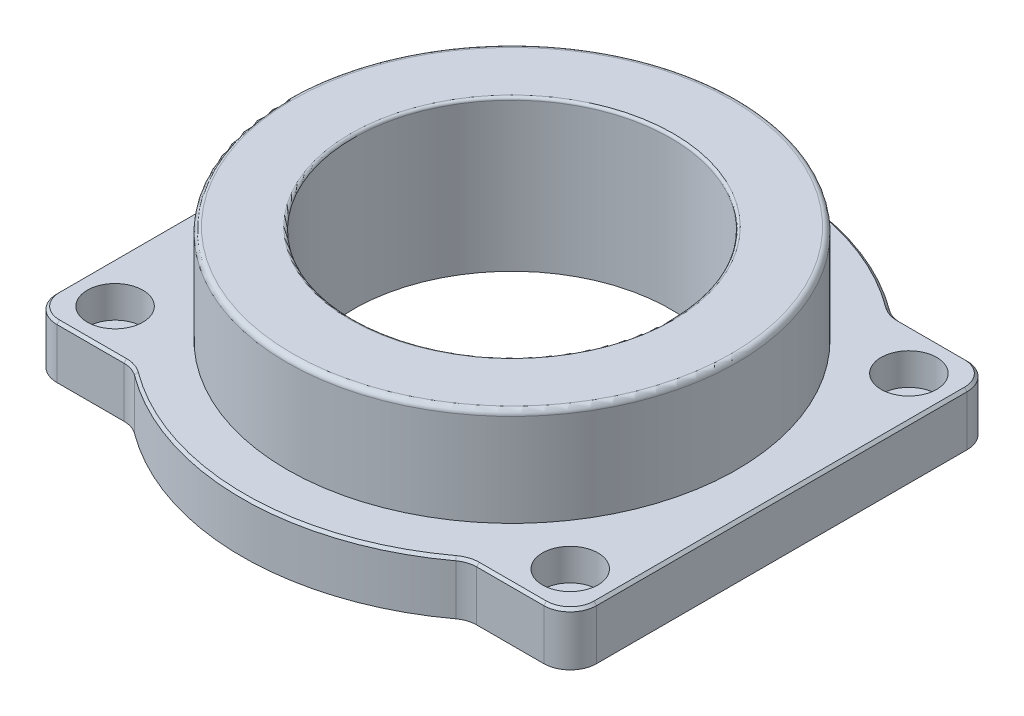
ISO-10303-21;
HEADER;
FILE_DESCRIPTION(('STEP AP214'),'2;1');
FILE_NAME('part.step','',(''),(''),'','','');
FILE_SCHEMA(('AUTOMOTIVE_DESIGN { 1 0 10303 214 1 1 1 1 }'));
ENDSEC;
DATA;
#1=APPLICATION_CONTEXT('core data for automotive mechanical design processes');
#2=APPLICATION_PROTOCOL_DEFINITION('international standard','automotive_design',2000,#1);
#3=PRODUCT_CONTEXT('',#1,'mechanical');
#4=PRODUCT('Part','Part','',(#3));
#5=PRODUCT_RELATED_PRODUCT_CATEGORY('part','',(#4));
#6=PRODUCT_DEFINITION_FORMATION('','',#4);
#7=PRODUCT_DEFINITION_CONTEXT('part definition',#1,'design');
#8=PRODUCT_DEFINITION('design','',#6,#7);
#9=PRODUCT_DEFINITION_SHAPE('','',#8);
#10=(LENGTH_UNIT() NAMED_UNIT(*) SI_UNIT(.MILLI.,.METRE.));
#11=(NAMED_UNIT(*) PLANE_ANGLE_UNIT() SI_UNIT($,.RADIAN.));
#12=(NAMED_UNIT(*) SI_UNIT($,.STERADIAN.) SOLID_ANGLE_UNIT());
#13=UNCERTAINTY_MEASURE_WITH_UNIT(LENGTH_MEASURE(1.E-05),#10,'distance_accuracy_value','');
#14=(GEOMETRIC_REPRESENTATION_CONTEXT(3) GLOBAL_UNCERTAINTY_ASSIGNED_CONTEXT((#13)) GLOBAL_UNIT_ASSIGNED_CONTEXT((#10,
#11,#12)) REPRESENTATION_CONTEXT('',''));
#15=CARTESIAN_POINT('',(0.,0.,0.));
#16=DIRECTION('',(0.,0.,1.));
#17=DIRECTION('',(1.,0.,0.));
#18=AXIS2_PLACEMENT_3D('',#15,#16,#17);
#19=CARTESIAN_POINT('',(-46.,10.,35.));
#20=DIRECTION('',(0.,-1.,0.));
#21=DIRECTION('',(0.,0.,-1.));
#22=AXIS2_PLACEMENT_3D('',#19,#20,#21);
#23=CYLINDRICAL_SURFACE('',#22,4.99999999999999);
#24=DIRECTION('',(0.,-1.,0.));
#25=VECTOR('',#24,1.);
#26=CARTESIAN_POINT('',(-46.,10.,40.));
#27=LINE('',#26,#25);
#28=CARTESIAN_POINT('',(-46.,9.50000000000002,40.));
#29=VERTEX_POINT('',#28);
#30=CARTESIAN_POINT('',(-46.,0.,40.));
#31=VERTEX_POINT('',#30);
#32=EDGE_CURVE('E195',#29,#31,#27,.T.);
#33=ORIENTED_EDGE('',*,*,#32,.F.);
#34=CARTESIAN_POINT('',(-46.,9.50000000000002,35.));
#35=DIRECTION('',(0.,1.,0.));
#36=DIRECTION('',(0.,0.,1.));
#37=AXIS2_PLACEMENT_3D('',#34,#35,#36);
#38=CIRCLE('',#37,4.99999999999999);
#39=CARTESIAN_POINT('',(-51.,9.50000000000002,35.));
#40=VERTEX_POINT('',#39);
#41=EDGE_CURVE('E339',#29,#40,#38,.F.);
#42=ORIENTED_EDGE('',*,*,#41,.T.);
#43=DIRECTION('',(0.,-1.,0.));
#44=VECTOR('',#43,1.);
#45=CARTESIAN_POINT('',(-51.,10.,35.));
#46=LINE('',#45,#44);
#47=CARTESIAN_POINT('',(-51.,0.,35.));
#48=VERTEX_POINT('',#47);
#49=EDGE_CURVE('E219',#40,#48,#46,.T.);
#50=ORIENTED_EDGE('',*,*,#49,.T.);
#51=CARTESIAN_POINT('',(-46.,0.,35.));
#52=DIRECTION('',(0.,1.,0.));
#53=DIRECTION('',(0.,0.,1.));
#54=AXIS2_PLACEMENT_3D('',#51,#52,#53);
#55=CIRCLE('',#54,4.99999999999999);
#56=EDGE_CURVE('E213',#48,#31,#55,.T.);
#57=ORIENTED_EDGE('',*,*,#56,.T.);
#58=EDGE_LOOP('',(#33,#42,#50,#57));
#59=FACE_BOUND('',#58,.T.);
#60=ADVANCED_FACE('F33',(#59),#23,.T.);
#61=CARTESIAN_POINT('',(-46.,10.,40.));
#62=DIRECTION('',(0.,0.,-1.));
#63=DIRECTION('',(-1.,0.,0.));
#64=AXIS2_PLACEMENT_3D('',#61,#62,#63);
#65=PLANE('',#64);
#66=DIRECTION('',(0.,-1.,0.));
#67=VECTOR('',#66,1.);
#68=CARTESIAN_POINT('',(-33.3316666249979,10.,40.));
#69=LINE('',#68,#67);
#70=CARTESIAN_POINT('',(-33.3316666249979,9.50000000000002,40.));
#71=VERTEX_POINT('',#70);
#72=CARTESIAN_POINT('',(-33.3316666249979,0.,40.));
#73=VERTEX_POINT('',#72);
#74=EDGE_CURVE('E207',#71,#73,#69,.T.);
#75=ORIENTED_EDGE('',*,*,#74,.F.);
#76=DIRECTION('',(-1.,0.,0.));
#77=VECTOR('',#76,1.);
#78=CARTESIAN_POINT('',(-46.,9.50000000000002,40.));
#79=LINE('',#78,#77);
#80=EDGE_CURVE('E202',#71,#29,#79,.T.);
#81=ORIENTED_EDGE('',*,*,#80,.T.);
#82=ORIENTED_EDGE('',*,*,#32,.T.);
#83=DIRECTION('',(1.,0.,0.));
#84=VECTOR('',#83,1.);
#85=CARTESIAN_POINT('',(-46.,0.,40.));
#86=LINE('',#85,#84);
#87=EDGE_CURVE('E199',#31,#73,#86,.T.);
#88=ORIENTED_EDGE('',*,*,#87,.T.);
#89=EDGE_LOOP('',(#75,#81,#82,#88));
#90=FACE_BOUND('',#89,.T.);
#91=ADVANCED_FACE('F198',(#90),#65,.F.);
#92=CARTESIAN_POINT('',(-33.3316666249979,10.,45.));
#93=DIRECTION('',(0.,-1.,0.));
#94=DIRECTION('',(0.,0.,-1.));
#95=AXIS2_PLACEMENT_3D('',#92,#93,#94);
#96=CYLINDRICAL_SURFACE('',#95,4.99999999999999);
#97=DIRECTION('',(0.,-1.,0.));
#98=VECTOR('',#97,1.);
#99=CARTESIAN_POINT('',(-30.3556249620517,10.,40.9821428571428));
#100=LINE('',#99,#98);
#101=CARTESIAN_POINT('',(-30.3556249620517,9.50000000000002,40.9821428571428));
#102=VERTEX_POINT('',#101);
#103=CARTESIAN_POINT('',(-30.3556249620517,0.,40.9821428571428));
#104=VERTEX_POINT('',#103);
#105=EDGE_CURVE('E292',#102,#104,#100,.T.);
#106=ORIENTED_EDGE('',*,*,#105,.F.);
#107=CARTESIAN_POINT('',(-33.3316666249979,9.50000000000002,45.));
#108=DIRECTION('',(0.,1.,0.));
#109=DIRECTION('',(0.,0.,1.));
#110=AXIS2_PLACEMENT_3D('',#107,#108,#109);
#111=CIRCLE('',#110,4.99999999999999);
#112=EDGE_CURVE('E332',#102,#71,#111,.T.);
#113=ORIENTED_EDGE('',*,*,#112,.T.);
#114=ORIENTED_EDGE('',*,*,#74,.T.);
#115=CARTESIAN_POINT('',(-33.3316666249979,0.,45.));
#116=DIRECTION('',(0.,-1.,0.));
#117=DIRECTION('',(0.,0.,1.));
#118=AXIS2_PLACEMENT_3D('',#115,#116,#117);
#119=CIRCLE('',#118,4.99999999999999);
#120=EDGE_CURVE('E216',#73,#104,#119,.T.);
#121=ORIENTED_EDGE('',*,*,#120,.T.);
#122=EDGE_LOOP('',(#106,#113,#114,#121));
#123=FACE_BOUND('',#122,.T.);
#124=ADVANCED_FACE('F429',(#123),#96,.F.);
#125=CARTESIAN_POINT('',(0.,10.,0.));
#126=DIRECTION('',(0.,-1.,0.));
#127=DIRECTION('',(0.,0.,-1.));
#128=AXIS2_PLACEMENT_3D('',#125,#126,#127);
#129=CYLINDRICAL_SURFACE('',#128,51.);
#130=DIRECTION('',(0.,-1.,0.));
#131=VECTOR('',#130,1.);
#132=CARTESIAN_POINT('',(30.3556249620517,10.,40.9821428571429));
#133=LINE('',#132,#131);
#134=CARTESIAN_POINT('',(30.3556249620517,9.50000000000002,40.9821428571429));
#135=VERTEX_POINT('',#134);
#136=CARTESIAN_POINT('',(30.3556249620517,0.,40.9821428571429));
#137=VERTEX_POINT('',#136);
#138=EDGE_CURVE('E290',#135,#137,#133,.T.);
#139=ORIENTED_EDGE('',*,*,#138,.F.);
#140=CARTESIAN_POINT('',(0.,9.50000000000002,0.));
#141=DIRECTION('',(0.,1.,0.));
#142=DIRECTION('',(0.,0.,1.));
#143=AXIS2_PLACEMENT_3D('',#140,#141,#142);
#144=CIRCLE('',#143,51.);
#145=EDGE_CURVE('E327',#135,#102,#144,.F.);
#146=ORIENTED_EDGE('',*,*,#145,.T.);
#147=ORIENTED_EDGE('',*,*,#105,.T.);
#148=CARTESIAN_POINT('',(0.,0.,0.));
#149=DIRECTION('',(0.,1.,0.));
#150=DIRECTION('',(0.,0.,1.));
#151=AXIS2_PLACEMENT_3D('',#148,#149,#150);
#152=CIRCLE('',#151,51.);
#153=EDGE_CURVE('E229',#104,#137,#152,.T.);
#154=ORIENTED_EDGE('',*,*,#153,.T.);
#155=EDGE_LOOP('',(#139,#146,#147,#154));
#156=FACE_BOUND('',#155,.T.);
#157=ADVANCED_FACE('F571',(#156),#129,.T.);
#158=CARTESIAN_POINT('',(33.3316666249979,10.,45.));
#159=DIRECTION('',(0.,-1.,0.));
#160=DIRECTION('',(0.,0.,-1.));
#161=AXIS2_PLACEMENT_3D('',#158,#159,#160);
#162=CYLINDRICAL_SURFACE('',#161,4.99999999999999);
#163=DIRECTION('',(0.,-1.,0.));
#164=VECTOR('',#163,1.);
#165=CARTESIAN_POINT('',(33.3316666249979,10.,40.));
#166=LINE('',#165,#164);
#167=CARTESIAN_POINT('',(33.3316666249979,9.50000000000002,40.));
#168=VERTEX_POINT('',#167);
#169=CARTESIAN_POINT('',(33.3316666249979,0.,40.));
#170=VERTEX_POINT('',#169);
#171=EDGE_CURVE('E288',#168,#170,#166,.T.);
#172=ORIENTED_EDGE('',*,*,#171,.F.);
#173=CARTESIAN_POINT('',(33.3316666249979,9.50000000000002,45.));
#174=DIRECTION('',(0.,1.,0.));
#175=DIRECTION('',(0.,0.,1.));
#176=AXIS2_PLACEMENT_3D('',#173,#174,#175);
#177=CIRCLE('',#176,4.99999999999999);
#178=EDGE_CURVE('E330',#168,#135,#177,.T.);
#179=ORIENTED_EDGE('',*,*,#178,.T.);
#180=ORIENTED_EDGE('',*,*,#138,.T.);
#181=CARTESIAN_POINT('',(33.3316666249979,0.,45.));
#182=DIRECTION('',(0.,-1.,0.));
#183=DIRECTION('',(0.,0.,-1.));
#184=AXIS2_PLACEMENT_3D('',#181,#182,#183);
#185=CIRCLE('',#184,4.99999999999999);
#186=EDGE_CURVE('E232',#137,#170,#185,.T.);
#187=ORIENTED_EDGE('',*,*,#186,.T.);
#188=EDGE_LOOP('',(#172,#179,#180,#187));
#189=FACE_BOUND('',#188,.T.);
#190=ADVANCED_FACE('F568',(#189),#162,.F.);
#191=CARTESIAN_POINT('',(33.3316666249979,10.,40.));
#192=DIRECTION('',(0.,0.,-1.));
#193=DIRECTION('',(-1.,0.,0.));
#194=AXIS2_PLACEMENT_3D('',#191,#192,#193);
#195=PLANE('',#194);
#196=DIRECTION('',(0.,-1.,0.));
#197=VECTOR('',#196,1.);
#198=CARTESIAN_POINT('',(46.,10.,40.));
#199=LINE('',#198,#197);
#200=CARTESIAN_POINT('',(46.,9.50000000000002,40.));
#201=VERTEX_POINT('',#200);
#202=CARTESIAN_POINT('',(46.,0.,40.));
#203=VERTEX_POINT('',#202);
#204=EDGE_CURVE('E286',#201,#203,#199,.T.);
#205=ORIENTED_EDGE('',*,*,#204,.F.);
#206=DIRECTION('',(-1.,0.,0.));
#207=VECTOR('',#206,1.);
#208=CARTESIAN_POINT('',(33.3316666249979,9.50000000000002,40.));
#209=LINE('',#208,#207);
#210=EDGE_CURVE('E334',#201,#168,#209,.T.);
#211=ORIENTED_EDGE('',*,*,#210,.T.);
#212=ORIENTED_EDGE('',*,*,#171,.T.);
#213=DIRECTION('',(1.,0.,0.));
#214=VECTOR('',#213,1.);
#215=CARTESIAN_POINT('',(33.3316666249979,0.,40.));
#216=LINE('',#215,#214);
#217=EDGE_CURVE('E235',#170,#203,#216,.T.);
#218=ORIENTED_EDGE('',*,*,#217,.T.);
#219=EDGE_LOOP('',(#205,#211,#212,#218));
#220=FACE_BOUND('',#219,.T.);
#221=ADVANCED_FACE('F563',(#220),#195,.F.);
#222=CARTESIAN_POINT('',(46.,10.,35.));
#223=DIRECTION('',(0.,-1.,0.));
#224=DIRECTION('',(0.,0.,-1.));
#225=AXIS2_PLACEMENT_3D('',#222,#223,#224);
#226=CYLINDRICAL_SURFACE('',#225,5.);
#227=DIRECTION('',(0.,-1.,0.));
#228=VECTOR('',#227,1.);
#229=CARTESIAN_POINT('',(51.,10.,35.));
#230=LINE('',#229,#228);
#231=CARTESIAN_POINT('',(51.,9.50000000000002,35.));
#232=VERTEX_POINT('',#231);
#233=CARTESIAN_POINT('',(51.,0.,35.));
#234=VERTEX_POINT('',#233);
#235=EDGE_CURVE('E284',#232,#234,#230,.T.);
#236=ORIENTED_EDGE('',*,*,#235,.F.);
#237=CARTESIAN_POINT('',(46.,9.50000000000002,35.));
#238=DIRECTION('',(0.,1.,0.));
#239=DIRECTION('',(0.,0.,1.));
#240=AXIS2_PLACEMENT_3D('',#237,#238,#239);
#241=CIRCLE('',#240,5.);
#242=EDGE_CURVE('E337',#232,#201,#241,.F.);
#243=ORIENTED_EDGE('',*,*,#242,.T.);
#244=ORIENTED_EDGE('',*,*,#204,.T.);
#245=CARTESIAN_POINT('',(46.,0.,35.));
#246=DIRECTION('',(0.,1.,0.));
#247=DIRECTION('',(0.,0.,1.));
#248=AXIS2_PLACEMENT_3D('',#245,#246,#247);
#249=CIRCLE('',#248,5.);
#250=EDGE_CURVE('E238',#203,#234,#249,.T.);
#251=ORIENTED_EDGE('',*,*,#250,.T.);
#252=EDGE_LOOP('',(#236,#243,#244,#251));
#253=FACE_BOUND('',#252,.T.);
#254=ADVANCED_FACE('F557',(#253),#226,.T.);
#255=CARTESIAN_POINT('',(51.,10.,-35.));
#256=DIRECTION('',(-1.,0.,0.));
#257=DIRECTION('',(0.,0.,1.));
#258=AXIS2_PLACEMENT_3D('',#255,#256,#257);
#259=PLANE('',#258);
#260=DIRECTION('',(0.,-1.,0.));
#261=VECTOR('',#260,1.);
#262=CARTESIAN_POINT('',(51.,10.,-35.));
#263=LINE('',#262,#261);
#264=CARTESIAN_POINT('',(51.,9.50000000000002,-35.));
#265=VERTEX_POINT('',#264);
#266=CARTESIAN_POINT('',(51.,0.,-35.));
#267=VERTEX_POINT('',#266);
#268=EDGE_CURVE('E282',#265,#267,#263,.T.);
#269=ORIENTED_EDGE('',*,*,#268,.F.);
#270=DIRECTION('',(0.,0.,1.));
#271=VECTOR('',#270,1.);
#272=CARTESIAN_POINT('',(51.,9.50000000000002,35.));
#273=LINE('',#272,#271);
#274=EDGE_CURVE('E341',#265,#232,#273,.T.);
#275=ORIENTED_EDGE('',*,*,#274,.T.);
#276=ORIENTED_EDGE('',*,*,#235,.T.);
#277=DIRECTION('',(0.,0.,-1.));
#278=VECTOR('',#277,1.);
#279=CARTESIAN_POINT('',(51.,0.,-35.));
#280=LINE('',#279,#278);
#281=EDGE_CURVE('E241',#234,#267,#280,.T.);
#282=ORIENTED_EDGE('',*,*,#281,.T.);
#283=EDGE_LOOP('',(#269,#275,#276,#282));
#284=FACE_BOUND('',#283,.T.);
#285=ADVANCED_FACE('F550',(#284),#259,.F.);
#286=CARTESIAN_POINT('',(46.,10.,-35.));
#287=DIRECTION('',(0.,-1.,0.));
#288=DIRECTION('',(0.,0.,-1.));
#289=AXIS2_PLACEMENT_3D('',#286,#287,#288);
#290=CYLINDRICAL_SURFACE('',#289,5.);
#291=DIRECTION('',(0.,-1.,0.));
#292=VECTOR('',#291,1.);
#293=CARTESIAN_POINT('',(46.,10.,-40.));
#294=LINE('',#293,#292);
#295=CARTESIAN_POINT('',(46.,9.50000000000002,-40.));
#296=VERTEX_POINT('',#295);
#297=CARTESIAN_POINT('',(46.,0.,-40.));
#298=VERTEX_POINT('',#297);
#299=EDGE_CURVE('E280',#296,#298,#294,.T.);
#300=ORIENTED_EDGE('',*,*,#299,.F.);
#301=CARTESIAN_POINT('',(46.,9.50000000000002,-35.));
#302=DIRECTION('',(0.,1.,0.));
#303=DIRECTION('',(0.,0.,1.));
#304=AXIS2_PLACEMENT_3D('',#301,#302,#303);
#305=CIRCLE('',#304,5.);
#306=EDGE_CURVE('E345',#296,#265,#305,.F.);
#307=ORIENTED_EDGE('',*,*,#306,.T.);
#308=ORIENTED_EDGE('',*,*,#268,.T.);
#309=CARTESIAN_POINT('',(46.,0.,-35.));
#310=DIRECTION('',(0.,1.,0.));
#311=DIRECTION('',(0.,0.,-1.));
#312=AXIS2_PLACEMENT_3D('',#309,#310,#311);
#313=CIRCLE('',#312,5.);
#314=EDGE_CURVE('E244',#267,#298,#313,.T.);
#315=ORIENTED_EDGE('',*,*,#314,.T.);
#316=EDGE_LOOP('',(#300,#307,#308,#315));
#317=FACE_BOUND('',#316,.T.);
#318=ADVANCED_FACE('F548',(#317),#290,.T.);
#319=CARTESIAN_POINT('',(33.3316666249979,10.,-40.));
#320=DIRECTION('',(0.,0.,1.));
#321=DIRECTION('',(1.,0.,0.));
#322=AXIS2_PLACEMENT_3D('',#319,#320,#321);
#323=PLANE('',#322);
#324=DIRECTION('',(0.,-1.,0.));
#325=VECTOR('',#324,1.);
#326=CARTESIAN_POINT('',(33.3316666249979,10.,-40.));
#327=LINE('',#326,#325);
#328=CARTESIAN_POINT('',(33.3316666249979,9.50000000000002,-40.));
#329=VERTEX_POINT('',#328);
#330=CARTESIAN_POINT('',(33.3316666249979,0.,-40.));
#331=VERTEX_POINT('',#330);
#332=EDGE_CURVE('E278',#329,#331,#327,.T.);
#333=ORIENTED_EDGE('',*,*,#332,.F.);
#334=DIRECTION('',(1.,0.,0.));
#335=VECTOR('',#334,1.);
#336=CARTESIAN_POINT('',(46.,9.50000000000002,-40.));
#337=LINE('',#336,#335);
#338=EDGE_CURVE('E349',#329,#296,#337,.T.);
#339=ORIENTED_EDGE('',*,*,#338,.T.);
#340=ORIENTED_EDGE('',*,*,#299,.T.);
#341=DIRECTION('',(-1.,0.,0.));
#342=VECTOR('',#341,1.);
#343=CARTESIAN_POINT('',(33.3316666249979,0.,-40.));
#344=LINE('',#343,#342);
#345=EDGE_CURVE('E247',#298,#331,#344,.T.);
#346=ORIENTED_EDGE('',*,*,#345,.T.);
#347=EDGE_LOOP('',(#333,#339,#340,#346));
#348=FACE_BOUND('',#347,.T.);
#349=ADVANCED_FACE('F513',(#348),#323,.F.);
#350=CARTESIAN_POINT('',(33.3316666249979,10.,-45.));
#351=DIRECTION('',(0.,-1.,0.));
#352=DIRECTION('',(0.,0.,-1.));
#353=AXIS2_PLACEMENT_3D('',#350,#351,#352);
#354=CYLINDRICAL_SURFACE('',#353,4.99999999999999);
#355=DIRECTION('',(0.,-1.,0.));
#356=VECTOR('',#355,1.);
#357=CARTESIAN_POINT('',(30.3556249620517,10.,-40.9821428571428));
#358=LINE('',#357,#356);
#359=CARTESIAN_POINT('',(30.3556249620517,9.50000000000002,-40.9821428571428));
#360=VERTEX_POINT('',#359);
#361=CARTESIAN_POINT('',(30.3556249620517,0.,-40.9821428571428));
#362=VERTEX_POINT('',#361);
#363=EDGE_CURVE('E276',#360,#362,#358,.T.);
#364=ORIENTED_EDGE('',*,*,#363,.F.);
#365=CARTESIAN_POINT('',(33.3316666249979,9.50000000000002,-45.));
#366=DIRECTION('',(0.,1.,0.));
#367=DIRECTION('',(0.,0.,1.));
#368=AXIS2_PLACEMENT_3D('',#365,#366,#367);
#369=CIRCLE('',#368,4.99999999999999);
#370=EDGE_CURVE('E353',#360,#329,#369,.T.);
#371=ORIENTED_EDGE('',*,*,#370,.T.);
#372=ORIENTED_EDGE('',*,*,#332,.T.);
#373=CARTESIAN_POINT('',(33.3316666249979,0.,-45.));
#374=DIRECTION('',(0.,-1.,0.));
#375=DIRECTION('',(0.,0.,1.));
#376=AXIS2_PLACEMENT_3D('',#373,#374,#375);
#377=CIRCLE('',#376,4.99999999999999);
#378=EDGE_CURVE('E250',#331,#362,#377,.T.);
#379=ORIENTED_EDGE('',*,*,#378,.T.);
#380=EDGE_LOOP('',(#364,#371,#372,#379));
#381=FACE_BOUND('',#380,.T.);
#382=ADVANCED_FACE('F511',(#381),#354,.F.);
#383=CARTESIAN_POINT('',(0.,10.,0.));
#384=DIRECTION('',(0.,-1.,0.));
#385=DIRECTION('',(0.,0.,-1.));
#386=AXIS2_PLACEMENT_3D('',#383,#384,#385);
#387=CYLINDRICAL_SURFACE('',#386,51.);
#388=DIRECTION('',(0.,-1.,0.));
#389=VECTOR('',#388,1.);
#390=CARTESIAN_POINT('',(-30.3556249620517,10.,-40.9821428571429));
#391=LINE('',#390,#389);
#392=CARTESIAN_POINT('',(-30.3556249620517,9.50000000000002,-40.9821428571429));
#393=VERTEX_POINT('',#392);
#394=CARTESIAN_POINT('',(-30.3556249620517,0.,-40.9821428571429));
#395=VERTEX_POINT('',#394);
#396=EDGE_CURVE('E274',#393,#395,#391,.T.);
#397=ORIENTED_EDGE('',*,*,#396,.F.);
#398=CARTESIAN_POINT('',(0.,9.50000000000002,0.));
#399=DIRECTION('',(0.,1.,0.));
#400=DIRECTION('',(0.,0.,1.));
#401=AXIS2_PLACEMENT_3D('',#398,#399,#400);
#402=CIRCLE('',#401,51.);
#403=EDGE_CURVE('E55',#393,#360,#402,.F.);
#404=ORIENTED_EDGE('',*,*,#403,.T.);
#405=ORIENTED_EDGE('',*,*,#363,.T.);
#406=CARTESIAN_POINT('',(0.,0.,0.));
#407=DIRECTION('',(0.,1.,0.));
#408=DIRECTION('',(0.,0.,1.));
#409=AXIS2_PLACEMENT_3D('',#406,#407,#408);
#410=CIRCLE('',#409,51.);
#411=EDGE_CURVE('E253',#362,#395,#410,.T.);
#412=ORIENTED_EDGE('',*,*,#411,.T.);
#413=EDGE_LOOP('',(#397,#404,#405,#412));
#414=FACE_BOUND('',#413,.T.);
#415=ADVANCED_FACE('F521',(#414),#387,.T.);
#416=CARTESIAN_POINT('',(-33.3316666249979,10.,-45.));
#417=DIRECTION('',(0.,-1.,0.));
#418=DIRECTION('',(0.,0.,-1.));
#419=AXIS2_PLACEMENT_3D('',#416,#417,#418);
#420=CYLINDRICAL_SURFACE('',#419,4.99999999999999);
#421=DIRECTION('',(0.,-1.,0.));
#422=VECTOR('',#421,1.);
#423=CARTESIAN_POINT('',(-33.3316666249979,10.,-40.));
#424=LINE('',#423,#422);
#425=CARTESIAN_POINT('',(-33.3316666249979,9.50000000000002,-40.));
#426=VERTEX_POINT('',#425);
#427=CARTESIAN_POINT('',(-33.3316666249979,0.,-40.));
#428=VERTEX_POINT('',#427);
#429=EDGE_CURVE('E272',#426,#428,#424,.T.);
#430=ORIENTED_EDGE('',*,*,#429,.F.);
#431=CARTESIAN_POINT('',(-33.3316666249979,9.50000000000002,-45.));
#432=DIRECTION('',(0.,1.,0.));
#433=DIRECTION('',(0.,0.,1.));
#434=AXIS2_PLACEMENT_3D('',#431,#432,#433);
#435=CIRCLE('',#434,4.99999999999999);
#436=EDGE_CURVE('E48',#426,#393,#435,.T.);
#437=ORIENTED_EDGE('',*,*,#436,.T.);
#438=ORIENTED_EDGE('',*,*,#396,.T.);
#439=CARTESIAN_POINT('',(-33.3316666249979,0.,-45.));
#440=DIRECTION('',(0.,-1.,0.));
#441=DIRECTION('',(0.,0.,1.));
#442=AXIS2_PLACEMENT_3D('',#439,#440,#441);
#443=CIRCLE('',#442,4.99999999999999);
#444=EDGE_CURVE('E256',#395,#428,#443,.T.);
#445=ORIENTED_EDGE('',*,*,#444,.T.);
#446=EDGE_LOOP('',(#430,#437,#438,#445));
#447=FACE_BOUND('',#446,.T.);
#448=ADVANCED_FACE('F522',(#447),#420,.F.);
#449=CARTESIAN_POINT('',(-46.,10.,-40.));
#450=DIRECTION('',(0.,0.,1.));
#451=DIRECTION('',(1.,0.,0.));
#452=AXIS2_PLACEMENT_3D('',#449,#450,#451);
#453=PLANE('',#452);
#454=DIRECTION('',(0.,-1.,0.));
#455=VECTOR('',#454,1.);
#456=CARTESIAN_POINT('',(-46.,10.,-40.));
#457=LINE('',#456,#455);
#458=CARTESIAN_POINT('',(-46.,9.50000000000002,-40.));
#459=VERTEX_POINT('',#458);
#460=CARTESIAN_POINT('',(-46.,0.,-40.));
#461=VERTEX_POINT('',#460);
#462=EDGE_CURVE('E270',#459,#461,#457,.T.);
#463=ORIENTED_EDGE('',*,*,#462,.F.);
#464=DIRECTION('',(1.,0.,0.));
#465=VECTOR('',#464,1.);
#466=CARTESIAN_POINT('',(-33.3316666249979,9.50000000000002,-40.));
#467=LINE('',#466,#465);
#468=EDGE_CURVE('E351',#459,#426,#467,.T.);
#469=ORIENTED_EDGE('',*,*,#468,.T.);
#470=ORIENTED_EDGE('',*,*,#429,.T.);
#471=DIRECTION('',(-1.,0.,0.));
#472=VECTOR('',#471,1.);
#473=CARTESIAN_POINT('',(-46.,0.,-40.));
#474=LINE('',#473,#472);
#475=EDGE_CURVE('E259',#428,#461,#474,.T.);
#476=ORIENTED_EDGE('',*,*,#475,.T.);
#477=EDGE_LOOP('',(#463,#469,#470,#476));
#478=FACE_BOUND('',#477,.T.);
#479=ADVANCED_FACE('F526',(#478),#453,.F.);
#480=CARTESIAN_POINT('',(-46.,10.,-35.));
#481=DIRECTION('',(0.,-1.,0.));
#482=DIRECTION('',(0.,0.,-1.));
#483=AXIS2_PLACEMENT_3D('',#480,#481,#482);
#484=CYLINDRICAL_SURFACE('',#483,4.99999999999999);
#485=DIRECTION('',(0.,-1.,0.));
#486=VECTOR('',#485,1.);
#487=CARTESIAN_POINT('',(-51.,10.,-35.));
#488=LINE('',#487,#486);
#489=CARTESIAN_POINT('',(-51.,9.50000000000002,-35.));
#490=VERTEX_POINT('',#489);
#491=CARTESIAN_POINT('',(-51.,0.,-35.));
#492=VERTEX_POINT('',#491);
#493=EDGE_CURVE('E268',#490,#492,#488,.T.);
#494=ORIENTED_EDGE('',*,*,#493,.F.);
#495=CARTESIAN_POINT('',(-46.,9.50000000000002,-35.));
#496=DIRECTION('',(0.,1.,0.));
#497=DIRECTION('',(0.,0.,1.));
#498=AXIS2_PLACEMENT_3D('',#495,#496,#497);
#499=CIRCLE('',#498,4.99999999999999);
#500=EDGE_CURVE('E347',#490,#459,#499,.F.);
#501=ORIENTED_EDGE('',*,*,#500,.T.);
#502=ORIENTED_EDGE('',*,*,#462,.T.);
#503=CARTESIAN_POINT('',(-46.,0.,-35.));
#504=DIRECTION('',(0.,1.,0.));
#505=DIRECTION('',(0.,0.,1.));
#506=AXIS2_PLACEMENT_3D('',#503,#504,#505);
#507=CIRCLE('',#506,4.99999999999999);
#508=EDGE_CURVE('E262',#461,#492,#507,.T.);
#509=ORIENTED_EDGE('',*,*,#508,.T.);
#510=EDGE_LOOP('',(#494,#501,#502,#509));
#511=FACE_BOUND('',#510,.T.);
#512=ADVANCED_FACE('F588',(#511),#484,.T.);
#513=CARTESIAN_POINT('',(-51.,10.,-35.));
#514=DIRECTION('',(1.,0.,0.));
#515=DIRECTION('',(0.,0.,-1.));
#516=AXIS2_PLACEMENT_3D('',#513,#514,#515);
#517=PLANE('',#516);
#518=ORIENTED_EDGE('',*,*,#49,.F.);
#519=DIRECTION('',(0.,0.,-1.));
#520=VECTOR('',#519,1.);
#521=CARTESIAN_POINT('',(-51.,9.50000000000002,-35.));
#522=LINE('',#521,#520);
#523=EDGE_CURVE('E343',#40,#490,#522,.T.);
#524=ORIENTED_EDGE('',*,*,#523,.T.);
#525=ORIENTED_EDGE('',*,*,#493,.T.);
#526=DIRECTION('',(0.,0.,1.));
#527=VECTOR('',#526,1.);
#528=CARTESIAN_POINT('',(-51.,0.,-35.));
#529=LINE('',#528,#527);
#530=EDGE_CURVE('E265',#492,#48,#529,.T.);
#531=ORIENTED_EDGE('',*,*,#530,.T.);
#532=EDGE_LOOP('',(#518,#524,#525,#531));
#533=FACE_BOUND('',#532,.T.);
#534=ADVANCED_FACE('F585',(#533),#517,.F.);
#535=CARTESIAN_POINT('',(-46.,10.,35.));
#536=DIRECTION('',(0.,1.,0.));
#537=DIRECTION('',(0.,0.,1.));
#538=AXIS2_PLACEMENT_3D('',#535,#536,#537);
#539=PLANE('',#538);
#540=CARTESIAN_POINT('',(-33.3316666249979,10.,45.));
#541=DIRECTION('',(0.,1.,0.));
#542=DIRECTION('',(0.,0.,1.));
#543=AXIS2_PLACEMENT_3D('',#540,#541,#542);
#544=CIRCLE('',#543,5.49999999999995);
#545=CARTESIAN_POINT('',(-33.3316666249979,10.,39.5));
#546=VERTEX_POINT('',#545);
#547=CARTESIAN_POINT('',(-30.0580207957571,10.,40.5803571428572));
#548=VERTEX_POINT('',#547);
#549=EDGE_CURVE('E320',#546,#548,#544,.F.);
#550=ORIENTED_EDGE('',*,*,#549,.T.);
#551=CARTESIAN_POINT('',(0.,10.,0.));
#552=DIRECTION('',(0.,1.,0.));
#553=DIRECTION('',(0.,0.,1.));
#554=AXIS2_PLACEMENT_3D('',#551,#552,#553);
#555=CIRCLE('',#554,50.5);
#556=CARTESIAN_POINT('',(30.0580207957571,10.,40.5803571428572));
#557=VERTEX_POINT('',#556);
#558=EDGE_CURVE('E324',#548,#557,#555,.T.);
#559=ORIENTED_EDGE('',*,*,#558,.T.);
#560=CARTESIAN_POINT('',(33.3316666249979,10.,45.));
#561=DIRECTION('',(0.,1.,0.));
#562=DIRECTION('',(0.,0.,1.));
#563=AXIS2_PLACEMENT_3D('',#560,#561,#562);
#564=CIRCLE('',#563,5.49999999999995);
#565=CARTESIAN_POINT('',(33.3316666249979,10.,39.5));
#566=VERTEX_POINT('',#565);
#567=EDGE_CURVE('E322',#557,#566,#564,.F.);
#568=ORIENTED_EDGE('',*,*,#567,.T.);
#569=DIRECTION('',(1.,0.,0.));
#570=VECTOR('',#569,1.);
#571=CARTESIAN_POINT('',(46.,10.,39.5));
#572=LINE('',#571,#570);
#573=CARTESIAN_POINT('',(46.,10.,39.5));
#574=VERTEX_POINT('',#573);
#575=EDGE_CURVE('E318',#566,#574,#572,.T.);
#576=ORIENTED_EDGE('',*,*,#575,.T.);
#577=CARTESIAN_POINT('',(46.,10.,35.));
#578=DIRECTION('',(0.,1.,0.));
#579=DIRECTION('',(0.,0.,1.));
#580=AXIS2_PLACEMENT_3D('',#577,#578,#579);
#581=CIRCLE('',#580,4.50000000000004);
#582=CARTESIAN_POINT('',(50.5,10.,35.));
#583=VERTEX_POINT('',#582);
#584=EDGE_CURVE('E314',#574,#583,#581,.T.);
#585=ORIENTED_EDGE('',*,*,#584,.T.);
#586=DIRECTION('',(0.,0.,-1.));
#587=VECTOR('',#586,1.);
#588=CARTESIAN_POINT('',(50.5,10.,-35.));
#589=LINE('',#588,#587);
#590=CARTESIAN_POINT('',(50.5,10.,-35.));
#591=VERTEX_POINT('',#590);
#592=EDGE_CURVE('E310',#583,#591,#589,.T.);
#593=ORIENTED_EDGE('',*,*,#592,.T.);
#594=CARTESIAN_POINT('',(46.,10.,-35.));
#595=DIRECTION('',(0.,1.,0.));
#596=DIRECTION('',(0.,0.,1.));
#597=AXIS2_PLACEMENT_3D('',#594,#595,#596);
#598=CIRCLE('',#597,4.50000000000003);
#599=CARTESIAN_POINT('',(46.,10.,-39.5));
#600=VERTEX_POINT('',#599);
#601=EDGE_CURVE('E306',#591,#600,#598,.T.);
#602=ORIENTED_EDGE('',*,*,#601,.T.);
#603=DIRECTION('',(-1.,0.,0.));
#604=VECTOR('',#603,1.);
#605=CARTESIAN_POINT('',(33.3316666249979,10.,-39.5));
#606=LINE('',#605,#604);
#607=CARTESIAN_POINT('',(33.3316666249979,10.,-39.5));
#608=VERTEX_POINT('',#607);
#609=EDGE_CURVE('E302',#600,#608,#606,.T.);
#610=ORIENTED_EDGE('',*,*,#609,.T.);
#611=CARTESIAN_POINT('',(33.3316666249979,10.,-45.));
#612=DIRECTION('',(0.,1.,0.));
#613=DIRECTION('',(0.,0.,1.));
#614=AXIS2_PLACEMENT_3D('',#611,#612,#613);
#615=CIRCLE('',#614,5.49999999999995);
#616=CARTESIAN_POINT('',(30.0580207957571,10.,-40.5803571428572));
#617=VERTEX_POINT('',#616);
#618=EDGE_CURVE('E298',#608,#617,#615,.F.);
#619=ORIENTED_EDGE('',*,*,#618,.T.);
#620=CARTESIAN_POINT('',(0.,10.,0.));
#621=DIRECTION('',(0.,1.,0.));
#622=DIRECTION('',(0.,0.,1.));
#623=AXIS2_PLACEMENT_3D('',#620,#621,#622);
#624=CIRCLE('',#623,50.5);
#625=CARTESIAN_POINT('',(-30.0580207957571,10.,-40.5803571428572));
#626=VERTEX_POINT('',#625);
#627=EDGE_CURVE('E206',#617,#626,#624,.T.);
#628=ORIENTED_EDGE('',*,*,#627,.T.);
#629=CARTESIAN_POINT('',(-33.3316666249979,10.,-45.));
#630=DIRECTION('',(0.,1.,0.));
#631=DIRECTION('',(0.,0.,1.));
#632=AXIS2_PLACEMENT_3D('',#629,#630,#631);
#633=CIRCLE('',#632,5.49999999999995);
#634=CARTESIAN_POINT('',(-33.3316666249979,10.,-39.5));
#635=VERTEX_POINT('',#634);
#636=EDGE_CURVE('E296',#626,#635,#633,.F.);
#637=ORIENTED_EDGE('',*,*,#636,.T.);
#638=DIRECTION('',(-1.,0.,0.));
#639=VECTOR('',#638,1.);
#640=CARTESIAN_POINT('',(-46.,10.,-39.5));
#641=LINE('',#640,#639);
#642=CARTESIAN_POINT('',(-46.,10.,-39.5));
#643=VERTEX_POINT('',#642);
#644=EDGE_CURVE('E300',#635,#643,#641,.T.);
#645=ORIENTED_EDGE('',*,*,#644,.T.);
#646=CARTESIAN_POINT('',(-46.,10.,-35.));
#647=DIRECTION('',(0.,1.,0.));
#648=DIRECTION('',(0.,0.,1.));
#649=AXIS2_PLACEMENT_3D('',#646,#647,#648);
#650=CIRCLE('',#649,4.50000000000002);
#651=CARTESIAN_POINT('',(-50.5,10.,-35.));
#652=VERTEX_POINT('',#651);
#653=EDGE_CURVE('E304',#643,#652,#650,.T.);
#654=ORIENTED_EDGE('',*,*,#653,.T.);
#655=DIRECTION('',(0.,0.,1.));
#656=VECTOR('',#655,1.);
#657=CARTESIAN_POINT('',(-50.5,10.,35.));
#658=LINE('',#657,#656);
#659=CARTESIAN_POINT('',(-50.5,10.,35.));
#660=VERTEX_POINT('',#659);
#661=EDGE_CURVE('E308',#652,#660,#658,.T.);
#662=ORIENTED_EDGE('',*,*,#661,.T.);
#663=CARTESIAN_POINT('',(-46.,10.,35.));
#664=DIRECTION('',(0.,1.,0.));
#665=DIRECTION('',(0.,0.,1.));
#666=AXIS2_PLACEMENT_3D('',#663,#664,#665);
#667=CIRCLE('',#666,4.50000000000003);
#668=CARTESIAN_POINT('',(-46.,10.,39.5));
#669=VERTEX_POINT('',#668);
#670=EDGE_CURVE('E312',#660,#669,#667,.T.);
#671=ORIENTED_EDGE('',*,*,#670,.T.);
#672=DIRECTION('',(1.,0.,0.));
#673=VECTOR('',#672,1.);
#674=CARTESIAN_POINT('',(-33.3316666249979,10.,39.5));
#675=LINE('',#674,#673);
#676=EDGE_CURVE('E316',#669,#546,#675,.T.);
#677=ORIENTED_EDGE('',*,*,#676,.T.);
#678=EDGE_LOOP('',(#550,#559,#568,#576,#585,#593,#602,#610,#619,#628,#637,#645,#654,#662,#671,#677));
#679=FACE_BOUND('',#678,.T.);
#680=CARTESIAN_POINT('',(-43.,10.,32.));
#681=DIRECTION('',(0.,1.,0.));
#682=DIRECTION('',(0.,0.,1.));
#683=AXIS2_PLACEMENT_3D('',#680,#681,#682);
#684=CIRCLE('',#683,5.25);
#685=CARTESIAN_POINT('',(-43.,10.,37.25));
#686=VERTEX_POINT('',#685);
#687=EDGE_CURVE('E404',#686,#686,#684,.T.);
#688=ORIENTED_EDGE('',*,*,#687,.F.);
#689=EDGE_LOOP('',(#688));
#690=FACE_BOUND('',#689,.T.);
#691=CARTESIAN_POINT('',(43.,10.,32.));
#692=DIRECTION('',(0.,1.,0.));
#693=DIRECTION('',(0.,0.,1.));
#694=AXIS2_PLACEMENT_3D('',#691,#692,#693);
#695=CIRCLE('',#694,5.25);
#696=CARTESIAN_POINT('',(43.,10.,37.25));
#697=VERTEX_POINT('',#696);
#698=EDGE_CURVE('E1019',#697,#697,#695,.T.);
#699=ORIENTED_EDGE('',*,*,#698,.F.);
#700=EDGE_LOOP('',(#699));
#701=FACE_BOUND('',#700,.T.);
#702=CARTESIAN_POINT('',(43.,10.,-32.));
#703=DIRECTION('',(0.,1.,0.));
#704=DIRECTION('',(0.,0.,1.));
#705=AXIS2_PLACEMENT_3D('',#702,#703,#704);
#706=CIRCLE('',#705,5.25);
#707=CARTESIAN_POINT('',(43.,10.,-26.75));
#708=VERTEX_POINT('',#707);
#709=EDGE_CURVE('E1009',#708,#708,#706,.T.);
#710=ORIENTED_EDGE('',*,*,#709,.F.);
#711=EDGE_LOOP('',(#710));
#712=FACE_BOUND('',#711,.T.);
#713=CARTESIAN_POINT('',(-43.,10.,-32.));
#714=DIRECTION('',(0.,1.,0.));
#715=DIRECTION('',(0.,0.,1.));
#716=AXIS2_PLACEMENT_3D('',#713,#714,#715);
#717=CIRCLE('',#716,5.25);
#718=CARTESIAN_POINT('',(-43.,10.,-26.75));
#719=VERTEX_POINT('',#718);
#720=EDGE_CURVE('E999',#719,#719,#717,.T.);
#721=ORIENTED_EDGE('',*,*,#720,.F.);
#722=EDGE_LOOP('',(#721));
#723=FACE_BOUND('',#722,.T.);
#724=CARTESIAN_POINT('',(0.,10.,0.));
#725=DIRECTION('',(0.,1.,0.));
#726=DIRECTION('',(0.,0.,1.));
#727=AXIS2_PLACEMENT_3D('',#724,#725,#726);
#728=CIRCLE('',#727,42.5);
#729=CARTESIAN_POINT('',(0.,10.,42.5));
#730=VERTEX_POINT('',#729);
#731=EDGE_CURVE('E221',#730,#730,#728,.T.);
#732=ORIENTED_EDGE('',*,*,#731,.F.);
#733=EDGE_LOOP('',(#732));
#734=FACE_BOUND('',#733,.T.);
#735=ADVANCED_FACE('F536',(#679,#690,#701,#712,#723,#734),#539,.T.);
#736=CARTESIAN_POINT('',(-46.,0.,35.));
#737=DIRECTION('',(0.,1.,0.));
#738=DIRECTION('',(0.,0.,1.));
#739=AXIS2_PLACEMENT_3D('',#736,#737,#738);
#740=PLANE('',#739);
#741=CARTESIAN_POINT('',(-43.,0.,32.));
#742=DIRECTION('',(0.,1.,0.));
#743=DIRECTION('',(0.,0.,1.));
#744=AXIS2_PLACEMENT_3D('',#741,#742,#743);
#745=CIRCLE('',#744,3.2);
#746=CARTESIAN_POINT('',(-43.,0.,35.2));
#747=VERTEX_POINT('',#746);
#748=EDGE_CURVE('E976',#747,#747,#745,.T.);
#749=ORIENTED_EDGE('',*,*,#748,.T.);
#750=EDGE_LOOP('',(#749));
#751=FACE_BOUND('',#750,.T.);
#752=CARTESIAN_POINT('',(43.,0.,32.));
#753=DIRECTION('',(0.,1.,0.));
#754=DIRECTION('',(0.,0.,1.));
#755=AXIS2_PLACEMENT_3D('',#752,#753,#754);
#756=CIRCLE('',#755,3.2);
#757=CARTESIAN_POINT('',(43.,0.,35.2));
#758=VERTEX_POINT('',#757);
#759=EDGE_CURVE('E980',#758,#758,#756,.T.);
#760=ORIENTED_EDGE('',*,*,#759,.T.);
#761=EDGE_LOOP('',(#760));
#762=FACE_BOUND('',#761,.T.);
#763=CARTESIAN_POINT('',(43.,0.,-32.));
#764=DIRECTION('',(0.,1.,0.));
#765=DIRECTION('',(0.,0.,1.));
#766=AXIS2_PLACEMENT_3D('',#763,#764,#765);
#767=CIRCLE('',#766,3.2);
#768=CARTESIAN_POINT('',(43.,0.,-28.8));
#769=VERTEX_POINT('',#768);
#770=EDGE_CURVE('E984',#769,#769,#767,.T.);
#771=ORIENTED_EDGE('',*,*,#770,.T.);
#772=EDGE_LOOP('',(#771));
#773=FACE_BOUND('',#772,.T.);
#774=CARTESIAN_POINT('',(-43.,0.,-32.));
#775=DIRECTION('',(0.,1.,0.));
#776=DIRECTION('',(0.,0.,1.));
#777=AXIS2_PLACEMENT_3D('',#774,#775,#776);
#778=CIRCLE('',#777,3.2);
#779=CARTESIAN_POINT('',(-43.,0.,-28.8));
#780=VERTEX_POINT('',#779);
#781=EDGE_CURVE('E988',#780,#780,#778,.T.);
#782=ORIENTED_EDGE('',*,*,#781,.T.);
#783=EDGE_LOOP('',(#782));
#784=FACE_BOUND('',#783,.T.);
#785=CARTESIAN_POINT('',(0.,0.,0.));
#786=DIRECTION('',(0.,1.,0.));
#787=DIRECTION('',(0.,0.,1.));
#788=AXIS2_PLACEMENT_3D('',#785,#786,#787);
#789=CIRCLE('',#788,30.);
#790=CARTESIAN_POINT('',(0.,0.,30.));
#791=VERTEX_POINT('',#790);
#792=EDGE_CURVE('E224',#791,#791,#789,.T.);
#793=ORIENTED_EDGE('',*,*,#792,.T.);
#794=EDGE_LOOP('',(#793));
#795=FACE_BOUND('',#794,.T.);
#796=ORIENTED_EDGE('',*,*,#56,.F.);
#797=ORIENTED_EDGE('',*,*,#530,.F.);
#798=ORIENTED_EDGE('',*,*,#508,.F.);
#799=ORIENTED_EDGE('',*,*,#475,.F.);
#800=ORIENTED_EDGE('',*,*,#444,.F.);
#801=ORIENTED_EDGE('',*,*,#411,.F.);
#802=ORIENTED_EDGE('',*,*,#378,.F.);
#803=ORIENTED_EDGE('',*,*,#345,.F.);
#804=ORIENTED_EDGE('',*,*,#314,.F.);
#805=ORIENTED_EDGE('',*,*,#281,.F.);
#806=ORIENTED_EDGE('',*,*,#250,.F.);
#807=ORIENTED_EDGE('',*,*,#217,.F.);
#808=ORIENTED_EDGE('',*,*,#186,.F.);
#809=ORIENTED_EDGE('',*,*,#153,.F.);
#810=ORIENTED_EDGE('',*,*,#120,.F.);
#811=ORIENTED_EDGE('',*,*,#87,.F.);
#812=EDGE_LOOP('',(#796,#797,#798,#799,#800,#801,#802,#803,#804,#805,#806,#807,#808,#809,#810,#811));
#813=FACE_BOUND('',#812,.T.);
#814=ADVANCED_FACE('F211',(#751,#762,#773,#784,#795,#813),#740,.F.);
#815=CARTESIAN_POINT('',(0.,28.5,0.));
#816=DIRECTION('',(0.,-1.,0.));
#817=DIRECTION('',(0.,0.,-1.));
#818=AXIS2_PLACEMENT_3D('',#815,#816,#817);
#819=CYLINDRICAL_SURFACE('',#818,42.5);
#820=CARTESIAN_POINT('',(0.,27.5,0.));
#821=DIRECTION('',(0.,1.,0.));
#822=DIRECTION('',(0.,0.,1.));
#823=AXIS2_PLACEMENT_3D('',#820,#821,#822);
#824=CIRCLE('',#823,42.5);
#825=CARTESIAN_POINT('',(0.,27.5,42.5));
#826=VERTEX_POINT('',#825);
#827=EDGE_CURVE('E407',#826,#826,#824,.F.);
#828=ORIENTED_EDGE('',*,*,#827,.T.);
#829=EDGE_LOOP('',(#828));
#830=FACE_BOUND('',#829,.T.);
#831=ORIENTED_EDGE('',*,*,#731,.T.);
#832=EDGE_LOOP('',(#831));
#833=FACE_BOUND('',#832,.T.);
#834=ADVANCED_FACE('F788',(#830,#833),#819,.T.);
#835=CARTESIAN_POINT('',(0.,28.5,0.));
#836=DIRECTION('',(0.,1.,0.));
#837=DIRECTION('',(0.,0.,1.));
#838=AXIS2_PLACEMENT_3D('',#835,#836,#837);
#839=PLANE('',#838);
#840=CARTESIAN_POINT('',(0.,28.5,0.));
#841=DIRECTION('',(0.,1.,0.));
#842=DIRECTION('',(0.,0.,1.));
#843=AXIS2_PLACEMENT_3D('',#840,#841,#842);
#844=CIRCLE('',#843,30.5);
#845=CARTESIAN_POINT('',(0.,28.5,30.5));
#846=VERTEX_POINT('',#845);
#847=EDGE_CURVE('E11',#846,#846,#844,.F.);
#848=ORIENTED_EDGE('',*,*,#847,.T.);
#849=EDGE_LOOP('',(#848));
#850=FACE_BOUND('',#849,.T.);
#851=CARTESIAN_POINT('',(0.,28.5,0.));
#852=DIRECTION('',(0.,1.,0.));
#853=DIRECTION('',(0.,0.,1.));
#854=AXIS2_PLACEMENT_3D('',#851,#852,#853);
#855=CIRCLE('',#854,41.5);
#856=CARTESIAN_POINT('',(0.,28.5,41.5));
#857=VERTEX_POINT('',#856);
#858=EDGE_CURVE('E357',#857,#857,#855,.T.);
#859=ORIENTED_EDGE('',*,*,#858,.T.);
#860=EDGE_LOOP('',(#859));
#861=FACE_BOUND('',#860,.T.);
#862=ADVANCED_FACE('F793',(#850,#861),#839,.T.);
#863=CARTESIAN_POINT('',(0.,0.,0.));
#864=DIRECTION('',(0.,1.,0.));
#865=DIRECTION('',(0.,0.,1.));
#866=AXIS2_PLACEMENT_3D('',#863,#864,#865);
#867=CYLINDRICAL_SURFACE('',#866,30.);
#868=CARTESIAN_POINT('',(0.,28.,0.));
#869=DIRECTION('',(0.,1.,0.));
#870=DIRECTION('',(0.,0.,1.));
#871=AXIS2_PLACEMENT_3D('',#868,#869,#870);
#872=CIRCLE('',#871,30.);
#873=CARTESIAN_POINT('',(0.,28.,30.));
#874=VERTEX_POINT('',#873);
#875=EDGE_CURVE('E41',#874,#874,#872,.T.);
#876=ORIENTED_EDGE('',*,*,#875,.T.);
#877=EDGE_LOOP('',(#876));
#878=FACE_BOUND('',#877,.T.);
#879=ORIENTED_EDGE('',*,*,#792,.F.);
#880=EDGE_LOOP('',(#879));
#881=FACE_BOUND('',#880,.T.);
#882=ADVANCED_FACE('F412',(#878,#881),#867,.F.);
#883=CARTESIAN_POINT('',(-43.,10.,-32.));
#884=DIRECTION('',(0.,1.,0.));
#885=DIRECTION('',(0.,0.,1.));
#886=AXIS2_PLACEMENT_3D('',#883,#884,#885);
#887=CYLINDRICAL_SURFACE('',#886,3.2);
#888=ORIENTED_EDGE('',*,*,#781,.F.);
#889=EDGE_LOOP('',(#888));
#890=FACE_BOUND('',#889,.T.);
#891=CARTESIAN_POINT('',(-43.,4.,-32.));
#892=DIRECTION('',(0.,1.,0.));
#893=DIRECTION('',(0.,0.,1.));
#894=AXIS2_PLACEMENT_3D('',#891,#892,#893);
#895=CIRCLE('',#894,3.2);
#896=CARTESIAN_POINT('',(-43.,4.,-28.8));
#897=VERTEX_POINT('',#896);
#898=EDGE_CURVE('E991',#897,#897,#895,.T.);
#899=ORIENTED_EDGE('',*,*,#898,.T.);
#900=EDGE_LOOP('',(#899));
#901=FACE_BOUND('',#900,.T.);
#902=ADVANCED_FACE('F817',(#890,#901),#887,.F.);
#903=CARTESIAN_POINT('',(-39.8,4.,-32.));
#904=DIRECTION('',(0.,-1.,0.));
#905=DIRECTION('',(0.,0.,-1.));
#906=AXIS2_PLACEMENT_3D('',#903,#904,#905);
#907=PLANE('',#906);
#908=ORIENTED_EDGE('',*,*,#898,.F.);
#909=EDGE_LOOP('',(#908));
#910=FACE_BOUND('',#909,.T.);
#911=CARTESIAN_POINT('',(-43.,4.,-32.));
#912=DIRECTION('',(0.,1.,0.));
#913=DIRECTION('',(0.,0.,1.));
#914=AXIS2_PLACEMENT_3D('',#911,#912,#913);
#915=CIRCLE('',#914,5.25);
#916=CARTESIAN_POINT('',(-43.,4.,-26.75));
#917=VERTEX_POINT('',#916);
#918=EDGE_CURVE('E996',#917,#917,#915,.T.);
#919=ORIENTED_EDGE('',*,*,#918,.T.);
#920=EDGE_LOOP('',(#919));
#921=FACE_BOUND('',#920,.T.);
#922=ADVANCED_FACE('F830',(#910,#921),#907,.F.);
#923=CARTESIAN_POINT('',(-43.,10.,-32.));
#924=DIRECTION('',(0.,1.,0.));
#925=DIRECTION('',(0.,0.,1.));
#926=AXIS2_PLACEMENT_3D('',#923,#924,#925);
#927=CYLINDRICAL_SURFACE('',#926,5.25);
#928=ORIENTED_EDGE('',*,*,#918,.F.);
#929=EDGE_LOOP('',(#928));
#930=FACE_BOUND('',#929,.T.);
#931=ORIENTED_EDGE('',*,*,#720,.T.);
#932=EDGE_LOOP('',(#931));
#933=FACE_BOUND('',#932,.T.);
#934=ADVANCED_FACE('F838',(#930,#933),#927,.F.);
#935=CARTESIAN_POINT('',(43.,10.,-32.));
#936=DIRECTION('',(0.,1.,0.));
#937=DIRECTION('',(0.,0.,1.));
#938=AXIS2_PLACEMENT_3D('',#935,#936,#937);
#939=CYLINDRICAL_SURFACE('',#938,3.2);
#940=ORIENTED_EDGE('',*,*,#770,.F.);
#941=EDGE_LOOP('',(#940));
#942=FACE_BOUND('',#941,.T.);
#943=CARTESIAN_POINT('',(43.,4.,-32.));
#944=DIRECTION('',(0.,1.,0.));
#945=DIRECTION('',(0.,0.,1.));
#946=AXIS2_PLACEMENT_3D('',#943,#944,#945);
#947=CIRCLE('',#946,3.2);
#948=CARTESIAN_POINT('',(43.,4.,-28.8));
#949=VERTEX_POINT('',#948);
#950=EDGE_CURVE('E1003',#949,#949,#947,.T.);
#951=ORIENTED_EDGE('',*,*,#950,.T.);
#952=EDGE_LOOP('',(#951));
#953=FACE_BOUND('',#952,.T.);
#954=ADVANCED_FACE('F846',(#942,#953),#939,.F.);
#955=CARTESIAN_POINT('',(46.2,4.,-32.));
#956=DIRECTION('',(0.,-1.,0.));
#957=DIRECTION('',(0.,0.,-1.));
#958=AXIS2_PLACEMENT_3D('',#955,#956,#957);
#959=PLANE('',#958);
#960=ORIENTED_EDGE('',*,*,#950,.F.);
#961=EDGE_LOOP('',(#960));
#962=FACE_BOUND('',#961,.T.);
#963=CARTESIAN_POINT('',(43.,4.,-32.));
#964=DIRECTION('',(0.,1.,0.));
#965=DIRECTION('',(0.,0.,1.));
#966=AXIS2_PLACEMENT_3D('',#963,#964,#965);
#967=CIRCLE('',#966,5.25);
#968=CARTESIAN_POINT('',(43.,4.,-26.75));
#969=VERTEX_POINT('',#968);
#970=EDGE_CURVE('E1006',#969,#969,#967,.T.);
#971=ORIENTED_EDGE('',*,*,#970,.T.);
#972=EDGE_LOOP('',(#971));
#973=FACE_BOUND('',#972,.T.);
#974=ADVANCED_FACE('F854',(#962,#973),#959,.F.);
#975=CARTESIAN_POINT('',(43.,10.,-32.));
#976=DIRECTION('',(0.,1.,0.));
#977=DIRECTION('',(0.,0.,1.));
#978=AXIS2_PLACEMENT_3D('',#975,#976,#977);
#979=CYLINDRICAL_SURFACE('',#978,5.25);
#980=ORIENTED_EDGE('',*,*,#970,.F.);
#981=EDGE_LOOP('',(#980));
#982=FACE_BOUND('',#981,.T.);
#983=ORIENTED_EDGE('',*,*,#709,.T.);
#984=EDGE_LOOP('',(#983));
#985=FACE_BOUND('',#984,.T.);
#986=ADVANCED_FACE('F862',(#982,#985),#979,.F.);
#987=CARTESIAN_POINT('',(43.,10.,32.));
#988=DIRECTION('',(0.,1.,0.));
#989=DIRECTION('',(0.,0.,1.));
#990=AXIS2_PLACEMENT_3D('',#987,#988,#989);
#991=CYLINDRICAL_SURFACE('',#990,3.2);
#992=ORIENTED_EDGE('',*,*,#759,.F.);
#993=EDGE_LOOP('',(#992));
#994=FACE_BOUND('',#993,.T.);
#995=CARTESIAN_POINT('',(43.,4.,32.));
#996=DIRECTION('',(0.,1.,0.));
#997=DIRECTION('',(0.,0.,1.));
#998=AXIS2_PLACEMENT_3D('',#995,#996,#997);
#999=CIRCLE('',#998,3.2);
#1000=CARTESIAN_POINT('',(43.,4.,35.2));
#1001=VERTEX_POINT('',#1000);
#1002=EDGE_CURVE('E1013',#1001,#1001,#999,.T.);
#1003=ORIENTED_EDGE('',*,*,#1002,.T.);
#1004=EDGE_LOOP('',(#1003));
#1005=FACE_BOUND('',#1004,.T.);
#1006=ADVANCED_FACE('F870',(#994,#1005),#991,.F.);
#1007=CARTESIAN_POINT('',(46.2,4.,32.));
#1008=DIRECTION('',(0.,-1.,0.));
#1009=DIRECTION('',(0.,0.,-1.));
#1010=AXIS2_PLACEMENT_3D('',#1007,#1008,#1009);
#1011=PLANE('',#1010);
#1012=ORIENTED_EDGE('',*,*,#1002,.F.);
#1013=EDGE_LOOP('',(#1012));
#1014=FACE_BOUND('',#1013,.T.);
#1015=CARTESIAN_POINT('',(43.,4.,32.));
#1016=DIRECTION('',(0.,1.,0.));
#1017=DIRECTION('',(0.,0.,1.));
#1018=AXIS2_PLACEMENT_3D('',#1015,#1016,#1017);
#1019=CIRCLE('',#1018,5.25);
#1020=CARTESIAN_POINT('',(43.,4.,37.25));
#1021=VERTEX_POINT('',#1020);
#1022=EDGE_CURVE('E1016',#1021,#1021,#1019,.T.);
#1023=ORIENTED_EDGE('',*,*,#1022,.T.);
#1024=EDGE_LOOP('',(#1023));
#1025=FACE_BOUND('',#1024,.T.);
#1026=ADVANCED_FACE('F878',(#1014,#1025),#1011,.F.);
#1027=CARTESIAN_POINT('',(43.,10.,32.));
#1028=DIRECTION('',(0.,1.,0.));
#1029=DIRECTION('',(0.,0.,1.));
#1030=AXIS2_PLACEMENT_3D('',#1027,#1028,#1029);
#1031=CYLINDRICAL_SURFACE('',#1030,5.25);
#1032=ORIENTED_EDGE('',*,*,#1022,.F.);
#1033=EDGE_LOOP('',(#1032));
#1034=FACE_BOUND('',#1033,.T.);
#1035=ORIENTED_EDGE('',*,*,#698,.T.);
#1036=EDGE_LOOP('',(#1035));
#1037=FACE_BOUND('',#1036,.T.);
#1038=ADVANCED_FACE('F886',(#1034,#1037),#1031,.F.);
#1039=CARTESIAN_POINT('',(-43.,10.,32.));
#1040=DIRECTION('',(0.,1.,0.));
#1041=DIRECTION('',(0.,0.,1.));
#1042=AXIS2_PLACEMENT_3D('',#1039,#1040,#1041);
#1043=CYLINDRICAL_SURFACE('',#1042,3.2);
#1044=ORIENTED_EDGE('',*,*,#748,.F.);
#1045=EDGE_LOOP('',(#1044));
#1046=FACE_BOUND('',#1045,.T.);
#1047=CARTESIAN_POINT('',(-43.,4.,32.));
#1048=DIRECTION('',(0.,1.,0.));
#1049=DIRECTION('',(0.,0.,1.));
#1050=AXIS2_PLACEMENT_3D('',#1047,#1048,#1049);
#1051=CIRCLE('',#1050,3.2);
#1052=CARTESIAN_POINT('',(-43.,4.,35.2));
#1053=VERTEX_POINT('',#1052);
#1054=EDGE_CURVE('E1023',#1053,#1053,#1051,.T.);
#1055=ORIENTED_EDGE('',*,*,#1054,.T.);
#1056=EDGE_LOOP('',(#1055));
#1057=FACE_BOUND('',#1056,.T.);
#1058=ADVANCED_FACE('F894',(#1046,#1057),#1043,.F.);
#1059=CARTESIAN_POINT('',(-39.8,4.,32.));
#1060=DIRECTION('',(0.,-1.,0.));
#1061=DIRECTION('',(0.,0.,-1.));
#1062=AXIS2_PLACEMENT_3D('',#1059,#1060,#1061);
#1063=PLANE('',#1062);
#1064=ORIENTED_EDGE('',*,*,#1054,.F.);
#1065=EDGE_LOOP('',(#1064));
#1066=FACE_BOUND('',#1065,.T.);
#1067=CARTESIAN_POINT('',(-43.,4.,32.));
#1068=DIRECTION('',(0.,1.,0.));
#1069=DIRECTION('',(0.,0.,1.));
#1070=AXIS2_PLACEMENT_3D('',#1067,#1068,#1069);
#1071=CIRCLE('',#1070,5.25);
#1072=CARTESIAN_POINT('',(-43.,4.,37.25));
#1073=VERTEX_POINT('',#1072);
#1074=EDGE_CURVE('E1026',#1073,#1073,#1071,.T.);
#1075=ORIENTED_EDGE('',*,*,#1074,.T.);
#1076=EDGE_LOOP('',(#1075));
#1077=FACE_BOUND('',#1076,.T.);
#1078=ADVANCED_FACE('F499',(#1066,#1077),#1063,.F.);
#1079=CARTESIAN_POINT('',(-43.,10.,32.));
#1080=DIRECTION('',(0.,1.,0.));
#1081=DIRECTION('',(0.,0.,1.));
#1082=AXIS2_PLACEMENT_3D('',#1079,#1080,#1081);
#1083=CYLINDRICAL_SURFACE('',#1082,5.25);
#1084=ORIENTED_EDGE('',*,*,#1074,.F.);
#1085=EDGE_LOOP('',(#1084));
#1086=FACE_BOUND('',#1085,.T.);
#1087=ORIENTED_EDGE('',*,*,#687,.T.);
#1088=EDGE_LOOP('',(#1087));
#1089=FACE_BOUND('',#1088,.T.);
#1090=ADVANCED_FACE('F494',(#1086,#1089),#1083,.F.);
#1091=CARTESIAN_POINT('',(0.,10.,0.));
#1092=DIRECTION('',(0.,-1.,0.));
#1093=DIRECTION('',(0.,0.,-1.));
#1094=AXIS2_PLACEMENT_3D('',#1091,#1092,#1093);
#1095=CONICAL_SURFACE('',#1094,50.5,0.785398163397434);
#1096=DIRECTION('',(-0.420875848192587,0.707106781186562,0.568210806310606));
#1097=VECTOR('',#1096,1.);
#1098=CARTESIAN_POINT('',(30.3556249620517,9.50000000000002,-40.9821428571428));
#1099=LINE('',#1098,#1097);
#1100=EDGE_CURVE('E398',#360,#617,#1099,.T.);
#1101=ORIENTED_EDGE('',*,*,#1100,.F.);
#1102=ORIENTED_EDGE('',*,*,#403,.F.);
#1103=DIRECTION('',(-0.420875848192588,-0.707106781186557,-0.568210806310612));
#1104=VECTOR('',#1103,1.);
#1105=CARTESIAN_POINT('',(-30.0580207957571,10.,-40.5803571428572));
#1106=LINE('',#1105,#1104);
#1107=EDGE_CURVE('E401',#626,#393,#1106,.T.);
#1108=ORIENTED_EDGE('',*,*,#1107,.F.);
#1109=ORIENTED_EDGE('',*,*,#627,.F.);
#1110=EDGE_LOOP('',(#1101,#1102,#1108,#1109));
#1111=FACE_BOUND('',#1110,.T.);
#1112=ADVANCED_FACE('F491',(#1111),#1095,.T.);
#1113=CARTESIAN_POINT('',(-33.3316666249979,10.,-45.));
#1114=DIRECTION('',(0.,1.,0.));
#1115=DIRECTION('',(0.,0.,1.));
#1116=AXIS2_PLACEMENT_3D('',#1113,#1114,#1115);
#1117=CONICAL_SURFACE('',#1116,5.49999999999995,0.785398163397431);
#1118=ORIENTED_EDGE('',*,*,#1107,.T.);
#1119=ORIENTED_EDGE('',*,*,#436,.F.);
#1120=DIRECTION('',(0.,-0.707106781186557,-0.707106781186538));
#1121=VECTOR('',#1120,1.);
#1122=CARTESIAN_POINT('',(-33.3316666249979,10.,-39.5));
#1123=LINE('',#1122,#1121);
#1124=EDGE_CURVE('E395',#635,#426,#1123,.T.);
#1125=ORIENTED_EDGE('',*,*,#1124,.F.);
#1126=ORIENTED_EDGE('',*,*,#636,.F.);
#1127=EDGE_LOOP('',(#1118,#1119,#1125,#1126));
#1128=FACE_BOUND('',#1127,.T.);
#1129=ADVANCED_FACE('F487',(#1128),#1117,.F.);
#1130=CARTESIAN_POINT('',(33.3316666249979,10.,-45.));
#1131=DIRECTION('',(0.,1.,0.));
#1132=DIRECTION('',(0.,0.,1.));
#1133=AXIS2_PLACEMENT_3D('',#1130,#1131,#1132);
#1134=CONICAL_SURFACE('',#1133,5.49999999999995,0.785398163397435);
#1135=ORIENTED_EDGE('',*,*,#1100,.T.);
#1136=ORIENTED_EDGE('',*,*,#618,.F.);
#1137=DIRECTION('',(0.,0.707106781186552,0.707106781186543));
#1138=VECTOR('',#1137,1.);
#1139=CARTESIAN_POINT('',(33.3316666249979,9.50000000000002,-40.));
#1140=LINE('',#1139,#1138);
#1141=EDGE_CURVE('E392',#329,#608,#1140,.T.);
#1142=ORIENTED_EDGE('',*,*,#1141,.F.);
#1143=ORIENTED_EDGE('',*,*,#370,.F.);
#1144=EDGE_LOOP('',(#1135,#1136,#1142,#1143));
#1145=FACE_BOUND('',#1144,.T.);
#1146=ADVANCED_FACE('F483',(#1145),#1134,.F.);
#1147=CARTESIAN_POINT('',(-46.,10.,-39.5));
#1148=DIRECTION('',(0.,0.707106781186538,-0.707106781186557));
#1149=DIRECTION('',(1.,0.,0.));
#1150=AXIS2_PLACEMENT_3D('',#1147,#1148,#1149);
#1151=PLANE('',#1150);
#1152=ORIENTED_EDGE('',*,*,#1124,.T.);
#1153=ORIENTED_EDGE('',*,*,#468,.F.);
#1154=DIRECTION('',(0.,-0.707106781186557,-0.707106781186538));
#1155=VECTOR('',#1154,1.);
#1156=CARTESIAN_POINT('',(-46.,10.,-39.5));
#1157=LINE('',#1156,#1155);
#1158=EDGE_CURVE('E389',#643,#459,#1157,.T.);
#1159=ORIENTED_EDGE('',*,*,#1158,.F.);
#1160=ORIENTED_EDGE('',*,*,#644,.F.);
#1161=EDGE_LOOP('',(#1152,#1153,#1159,#1160));
#1162=FACE_BOUND('',#1161,.T.);
#1163=ADVANCED_FACE('F479',(#1162),#1151,.T.);
#1164=CARTESIAN_POINT('',(-46.,10.,-39.5000000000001));
#1165=DIRECTION('',(0.,0.707106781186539,-0.707106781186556));
#1166=DIRECTION('',(1.,0.,0.));
#1167=AXIS2_PLACEMENT_3D('',#1164,#1165,#1166);
#1168=PLANE('',#1167);
#1169=ORIENTED_EDGE('',*,*,#1141,.T.);
#1170=ORIENTED_EDGE('',*,*,#609,.F.);
#1171=DIRECTION('',(0.,0.707106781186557,0.707106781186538));
#1172=VECTOR('',#1171,1.);
#1173=CARTESIAN_POINT('',(46.,9.50000000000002,-40.));
#1174=LINE('',#1173,#1172);
#1175=EDGE_CURVE('E386',#296,#600,#1174,.T.);
#1176=ORIENTED_EDGE('',*,*,#1175,.F.);
#1177=ORIENTED_EDGE('',*,*,#338,.F.);
#1178=EDGE_LOOP('',(#1169,#1170,#1176,#1177));
#1179=FACE_BOUND('',#1178,.T.);
#1180=ADVANCED_FACE('F475',(#1179),#1168,.T.);
#1181=CARTESIAN_POINT('',(-46.,10.,-35.));
#1182=DIRECTION('',(0.,-1.,0.));
#1183=DIRECTION('',(0.,0.,-1.));
#1184=AXIS2_PLACEMENT_3D('',#1181,#1182,#1183);
#1185=CONICAL_SURFACE('',#1184,4.50000000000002,0.785398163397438);
#1186=ORIENTED_EDGE('',*,*,#1158,.T.);
#1187=ORIENTED_EDGE('',*,*,#500,.F.);
#1188=DIRECTION('',(-0.707106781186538,-0.707106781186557,0.));
#1189=VECTOR('',#1188,1.);
#1190=CARTESIAN_POINT('',(-50.5,10.,-35.));
#1191=LINE('',#1190,#1189);
#1192=EDGE_CURVE('E383',#652,#490,#1191,.T.);
#1193=ORIENTED_EDGE('',*,*,#1192,.F.);
#1194=ORIENTED_EDGE('',*,*,#653,.F.);
#1195=EDGE_LOOP('',(#1186,#1187,#1193,#1194));
#1196=FACE_BOUND('',#1195,.T.);
#1197=ADVANCED_FACE('F471',(#1196),#1185,.T.);
#1198=CARTESIAN_POINT('',(46.,10.,-35.));
#1199=DIRECTION('',(0.,-1.,0.));
#1200=DIRECTION('',(0.,0.,-1.));
#1201=AXIS2_PLACEMENT_3D('',#1198,#1199,#1200);
#1202=CONICAL_SURFACE('',#1201,4.50000000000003,0.785398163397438);
#1203=ORIENTED_EDGE('',*,*,#1175,.T.);
#1204=ORIENTED_EDGE('',*,*,#601,.F.);
#1205=DIRECTION('',(-0.707106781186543,0.707106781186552,0.));
#1206=VECTOR('',#1205,1.);
#1207=CARTESIAN_POINT('',(51.,9.50000000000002,-35.));
#1208=LINE('',#1207,#1206);
#1209=EDGE_CURVE('E380',#265,#591,#1208,.T.);
#1210=ORIENTED_EDGE('',*,*,#1209,.F.);
#1211=ORIENTED_EDGE('',*,*,#306,.F.);
#1212=EDGE_LOOP('',(#1203,#1204,#1210,#1211));
#1213=FACE_BOUND('',#1212,.T.);
#1214=ADVANCED_FACE('F467',(#1213),#1202,.T.);
#1215=CARTESIAN_POINT('',(-50.5,10.,35.));
#1216=DIRECTION('',(-0.707106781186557,0.707106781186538,0.));
#1217=DIRECTION('',(0.,0.,-1.));
#1218=AXIS2_PLACEMENT_3D('',#1215,#1216,#1217);
#1219=PLANE('',#1218);
#1220=ORIENTED_EDGE('',*,*,#1192,.T.);
#1221=ORIENTED_EDGE('',*,*,#523,.F.);
#1222=DIRECTION('',(-0.707106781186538,-0.707106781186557,0.));
#1223=VECTOR('',#1222,1.);
#1224=CARTESIAN_POINT('',(-50.5,10.,35.));
#1225=LINE('',#1224,#1223);
#1226=EDGE_CURVE('E377',#660,#40,#1225,.T.);
#1227=ORIENTED_EDGE('',*,*,#1226,.F.);
#1228=ORIENTED_EDGE('',*,*,#661,.F.);
#1229=EDGE_LOOP('',(#1220,#1221,#1227,#1228));
#1230=FACE_BOUND('',#1229,.T.);
#1231=ADVANCED_FACE('F463',(#1230),#1219,.T.);
#1232=CARTESIAN_POINT('',(50.5,10.,35.));
#1233=DIRECTION('',(0.707106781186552,0.707106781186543,0.));
#1234=DIRECTION('',(0.,0.,1.));
#1235=AXIS2_PLACEMENT_3D('',#1232,#1233,#1234);
#1236=PLANE('',#1235);
#1237=ORIENTED_EDGE('',*,*,#1209,.T.);
#1238=ORIENTED_EDGE('',*,*,#592,.F.);
#1239=DIRECTION('',(-0.707106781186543,0.707106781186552,0.));
#1240=VECTOR('',#1239,1.);
#1241=CARTESIAN_POINT('',(51.,9.50000000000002,35.));
#1242=LINE('',#1241,#1240);
#1243=EDGE_CURVE('E374',#232,#583,#1242,.T.);
#1244=ORIENTED_EDGE('',*,*,#1243,.F.);
#1245=ORIENTED_EDGE('',*,*,#274,.F.);
#1246=EDGE_LOOP('',(#1237,#1238,#1244,#1245));
#1247=FACE_BOUND('',#1246,.T.);
#1248=ADVANCED_FACE('F459',(#1247),#1236,.T.);
#1249=CARTESIAN_POINT('',(-46.,10.,35.));
#1250=DIRECTION('',(0.,-1.,0.));
#1251=DIRECTION('',(0.,0.,-1.));
#1252=AXIS2_PLACEMENT_3D('',#1249,#1250,#1251);
#1253=CONICAL_SURFACE('',#1252,4.50000000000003,0.785398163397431);
#1254=ORIENTED_EDGE('',*,*,#1226,.T.);
#1255=ORIENTED_EDGE('',*,*,#41,.F.);
#1256=DIRECTION('',(0.,-0.707106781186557,0.707106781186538));
#1257=VECTOR('',#1256,1.);
#1258=CARTESIAN_POINT('',(-46.,10.,39.5));
#1259=LINE('',#1258,#1257);
#1260=EDGE_CURVE('E371',#669,#29,#1259,.T.);
#1261=ORIENTED_EDGE('',*,*,#1260,.F.);
#1262=ORIENTED_EDGE('',*,*,#670,.F.);
#1263=EDGE_LOOP('',(#1254,#1255,#1261,#1262));
#1264=FACE_BOUND('',#1263,.T.);
#1265=ADVANCED_FACE('F455',(#1264),#1253,.T.);
#1266=CARTESIAN_POINT('',(46.,10.,35.));
#1267=DIRECTION('',(0.,-1.,0.));
#1268=DIRECTION('',(0.,0.,-1.));
#1269=AXIS2_PLACEMENT_3D('',#1266,#1267,#1268);
#1270=CONICAL_SURFACE('',#1269,4.50000000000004,0.785398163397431);
#1271=ORIENTED_EDGE('',*,*,#1243,.T.);
#1272=ORIENTED_EDGE('',*,*,#584,.F.);
#1273=DIRECTION('',(0.,0.707106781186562,-0.707106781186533));
#1274=VECTOR('',#1273,1.);
#1275=CARTESIAN_POINT('',(46.,9.50000000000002,40.));
#1276=LINE('',#1275,#1274);
#1277=EDGE_CURVE('E368',#201,#574,#1276,.T.);
#1278=ORIENTED_EDGE('',*,*,#1277,.F.);
#1279=ORIENTED_EDGE('',*,*,#242,.F.);
#1280=EDGE_LOOP('',(#1271,#1272,#1278,#1279));
#1281=FACE_BOUND('',#1280,.T.);
#1282=ADVANCED_FACE('F451',(#1281),#1270,.T.);
#1283=CARTESIAN_POINT('',(-46.,10.,39.5));
#1284=DIRECTION('',(0.,0.707106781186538,0.707106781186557));
#1285=DIRECTION('',(-1.,0.,0.));
#1286=AXIS2_PLACEMENT_3D('',#1283,#1284,#1285);
#1287=PLANE('',#1286);
#1288=ORIENTED_EDGE('',*,*,#1260,.T.);
#1289=ORIENTED_EDGE('',*,*,#80,.F.);
#1290=DIRECTION('',(0.,-0.707106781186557,0.707106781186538));
#1291=VECTOR('',#1290,1.);
#1292=CARTESIAN_POINT('',(-33.3316666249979,10.,39.5));
#1293=LINE('',#1292,#1291);
#1294=EDGE_CURVE('E365',#546,#71,#1293,.T.);
#1295=ORIENTED_EDGE('',*,*,#1294,.F.);
#1296=ORIENTED_EDGE('',*,*,#676,.F.);
#1297=EDGE_LOOP('',(#1288,#1289,#1295,#1296));
#1298=FACE_BOUND('',#1297,.T.);
#1299=ADVANCED_FACE('F447',(#1298),#1287,.T.);
#1300=CARTESIAN_POINT('',(-46.,10.,39.5000000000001));
#1301=DIRECTION('',(0.,0.707106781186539,0.707106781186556));
#1302=DIRECTION('',(-1.,0.,0.));
#1303=AXIS2_PLACEMENT_3D('',#1300,#1301,#1302);
#1304=PLANE('',#1303);
#1305=ORIENTED_EDGE('',*,*,#1277,.T.);
#1306=ORIENTED_EDGE('',*,*,#575,.F.);
#1307=DIRECTION('',(0.,0.707106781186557,-0.707106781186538));
#1308=VECTOR('',#1307,1.);
#1309=CARTESIAN_POINT('',(33.3316666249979,9.50000000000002,40.));
#1310=LINE('',#1309,#1308);
#1311=EDGE_CURVE('E362',#168,#566,#1310,.T.);
#1312=ORIENTED_EDGE('',*,*,#1311,.F.);
#1313=ORIENTED_EDGE('',*,*,#210,.F.);
#1314=EDGE_LOOP('',(#1305,#1306,#1312,#1313));
#1315=FACE_BOUND('',#1314,.T.);
#1316=ADVANCED_FACE('F443',(#1315),#1304,.T.);
#1317=CARTESIAN_POINT('',(-33.3316666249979,10.,45.));
#1318=DIRECTION('',(0.,1.,0.));
#1319=DIRECTION('',(0.,0.,1.));
#1320=AXIS2_PLACEMENT_3D('',#1317,#1318,#1319);
#1321=CONICAL_SURFACE('',#1320,5.49999999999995,0.785398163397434);
#1322=ORIENTED_EDGE('',*,*,#1294,.T.);
#1323=ORIENTED_EDGE('',*,*,#112,.F.);
#1324=DIRECTION('',(-0.420875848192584,-0.707106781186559,0.568210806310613));
#1325=VECTOR('',#1324,1.);
#1326=CARTESIAN_POINT('',(-30.0580207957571,10.,40.5803571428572));
#1327=LINE('',#1326,#1325);
#1328=EDGE_CURVE('E360',#548,#102,#1327,.T.);
#1329=ORIENTED_EDGE('',*,*,#1328,.F.);
#1330=ORIENTED_EDGE('',*,*,#549,.F.);
#1331=EDGE_LOOP('',(#1322,#1323,#1329,#1330));
#1332=FACE_BOUND('',#1331,.T.);
#1333=ADVANCED_FACE('F439',(#1332),#1321,.F.);
#1334=CARTESIAN_POINT('',(33.3316666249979,10.,45.));
#1335=DIRECTION('',(0.,1.,0.));
#1336=DIRECTION('',(0.,0.,1.));
#1337=AXIS2_PLACEMENT_3D('',#1334,#1335,#1336);
#1338=CONICAL_SURFACE('',#1337,5.49999999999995,0.785398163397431);
#1339=ORIENTED_EDGE('',*,*,#1311,.T.);
#1340=ORIENTED_EDGE('',*,*,#567,.F.);
#1341=DIRECTION('',(-0.420875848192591,0.707106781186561,-0.568210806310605));
#1342=VECTOR('',#1341,1.);
#1343=CARTESIAN_POINT('',(30.3556249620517,9.50000000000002,40.9821428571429));
#1344=LINE('',#1343,#1342);
#1345=EDGE_CURVE('E358',#135,#557,#1344,.T.);
#1346=ORIENTED_EDGE('',*,*,#1345,.F.);
#1347=ORIENTED_EDGE('',*,*,#178,.F.);
#1348=EDGE_LOOP('',(#1339,#1340,#1346,#1347));
#1349=FACE_BOUND('',#1348,.T.);
#1350=ADVANCED_FACE('F435',(#1349),#1338,.F.);
#1351=CARTESIAN_POINT('',(0.,10.,0.));
#1352=DIRECTION('',(0.,-1.,0.));
#1353=DIRECTION('',(0.,0.,-1.));
#1354=AXIS2_PLACEMENT_3D('',#1351,#1352,#1353);
#1355=CONICAL_SURFACE('',#1354,50.5,0.785398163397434);
#1356=ORIENTED_EDGE('',*,*,#1328,.T.);
#1357=ORIENTED_EDGE('',*,*,#145,.F.);
#1358=ORIENTED_EDGE('',*,*,#1345,.T.);
#1359=ORIENTED_EDGE('',*,*,#558,.F.);
#1360=EDGE_LOOP('',(#1356,#1357,#1358,#1359));
#1361=FACE_BOUND('',#1360,.T.);
#1362=ADVANCED_FACE('F421',(#1361),#1355,.T.);
#1363=CARTESIAN_POINT('',(0.,27.5,0.));
#1364=DIRECTION('',(0.,1.,0.));
#1365=DIRECTION('',(0.,0.,1.));
#1366=AXIS2_PLACEMENT_3D('',#1363,#1364,#1365);
#1367=TOROIDAL_SURFACE('',#1366,41.5,1.);
#1368=ORIENTED_EDGE('',*,*,#827,.F.);
#1369=EDGE_LOOP('',(#1368));
#1370=FACE_BOUND('',#1369,.T.);
#1371=ORIENTED_EDGE('',*,*,#858,.F.);
#1372=EDGE_LOOP('',(#1371));
#1373=FACE_BOUND('',#1372,.T.);
#1374=ADVANCED_FACE('F416',(#1370,#1373),#1367,.T.);
#1375=CARTESIAN_POINT('',(0.,28.,0.));
#1376=DIRECTION('',(0.,1.,0.));
#1377=DIRECTION('',(0.,0.,1.));
#1378=AXIS2_PLACEMENT_3D('',#1375,#1376,#1377);
#1379=TOROIDAL_SURFACE('',#1378,30.5,0.5);
#1380=ORIENTED_EDGE('',*,*,#847,.F.);
#1381=EDGE_LOOP('',(#1380));
#1382=FACE_BOUND('',#1381,.T.);
#1383=ORIENTED_EDGE('',*,*,#875,.F.);
#1384=EDGE_LOOP('',(#1383));
#1385=FACE_BOUND('',#1384,.T.);
#1386=ADVANCED_FACE('F35',(#1382,#1385),#1379,.T.);
#1387=CLOSED_SHELL('',(#60,#91,#124,#157,#190,#221,#254,#285,#318,#349,#382,#415,#448,#479,#512,
#534,#735,#814,#834,#862,#882,#902,#922,#934,#954,#974,#986,#1006,#1026,#1038,#1058,#1078,#1090,
#1112,#1129,#1146,#1163,#1180,#1197,#1214,#1231,#1248,#1265,#1282,#1299,#1316,#1333,#1350,#1362,
#1374,#1386));
#1388=MANIFOLD_SOLID_BREP('B2',#1387);
#1389=ADVANCED_BREP_SHAPE_REPRESENTATION('',(#18,#1388),#14);
#1390=SHAPE_DEFINITION_REPRESENTATION(#9,#1389);
ENDSEC;
END-ISO-10303-21;
